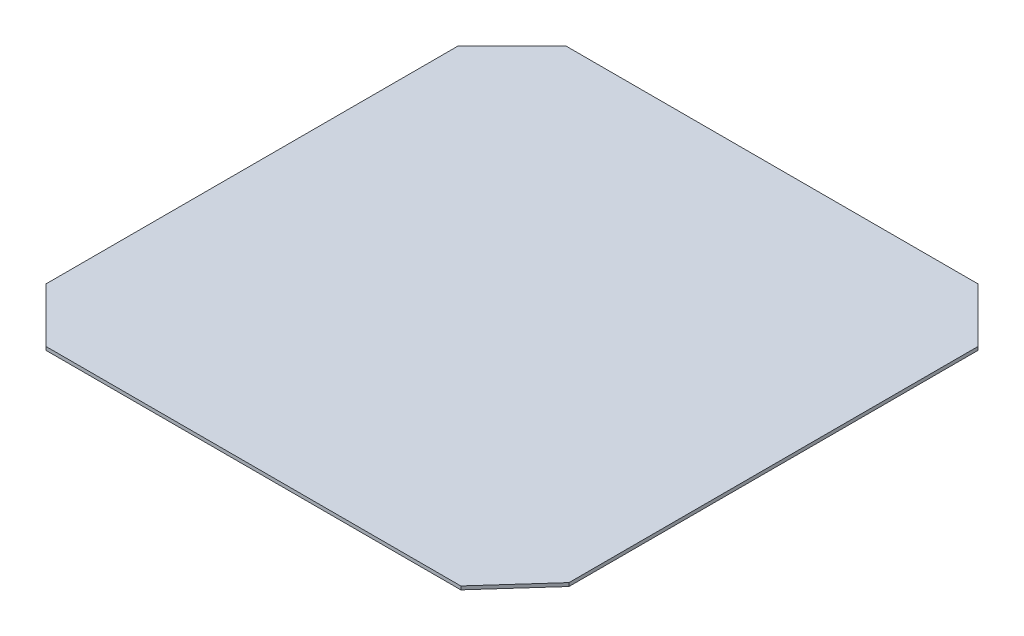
from build123d import *

# Parameters (mm, degrees)
BOSS_EXTRUDE1_DEPTH = 4


with BuildPart() as part:
    # Sketch2 → Boss-Extrude1 (new body)
    with BuildSketch(Plane(origin=(0, 0, 0), x_dir=(1, 0, 0), z_dir=(0, 1, 0))):
        Polygon((304.8, -237.994520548), (304.8, 241.3), (241.3, 304.8), (-241.3, 304.8), (-304.8, 241.3), (-304.8, -241.3), (-241.3, -304.8), (244.787268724, -304.8), align=None)
    extrude(amount=BOSS_EXTRUDE1_DEPTH)


solid = part.part
